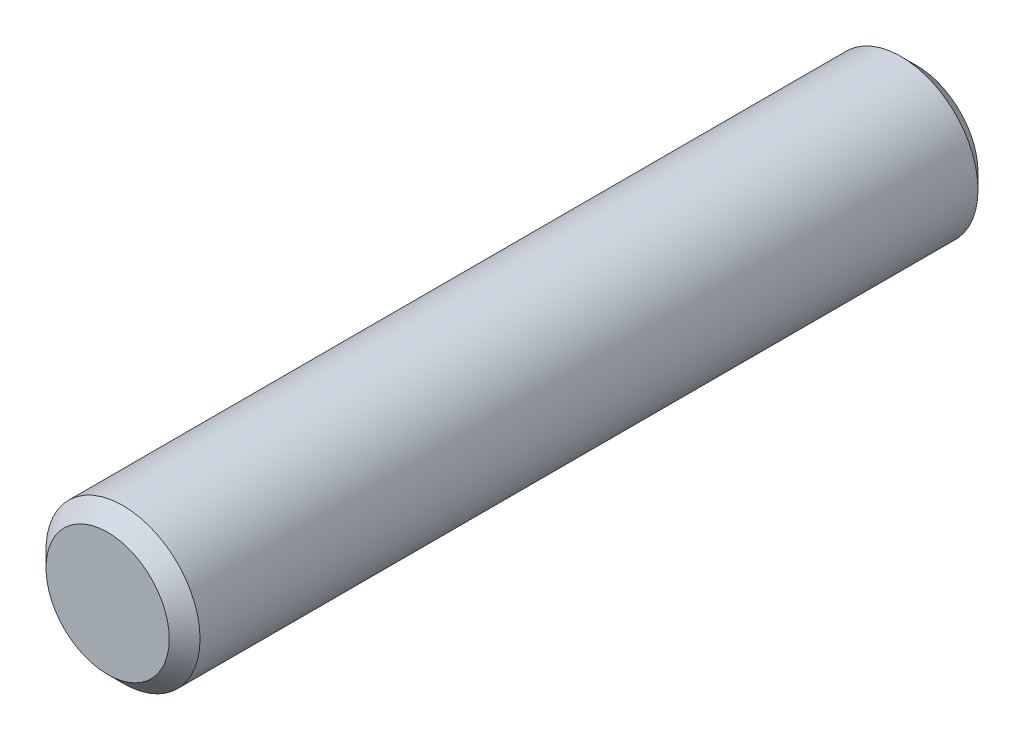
from build123d import *

# Parameters (mm, degrees)
ESQUISSE1_R      = 10
EXTRUSION1_DEPTH = 105
CHANFREIN1_SIZE  = 2


with BuildPart() as part:
    # Esquisse1 → Extrusion1 (new body)
    with BuildSketch(Plane.XY):
        Circle(ESQUISSE1_R)
    extrude(amount=EXTRUSION1_DEPTH)

    # Chanfrein1
    chanfrein1_edges = [part.edges().sort_by_distance(p)[0] for p in [
        (-10, 0, 0),
        (-10, 0, 105),
    ]]
    chamfer(chanfrein1_edges, length=CHANFREIN1_SIZE)


solid = part.part
